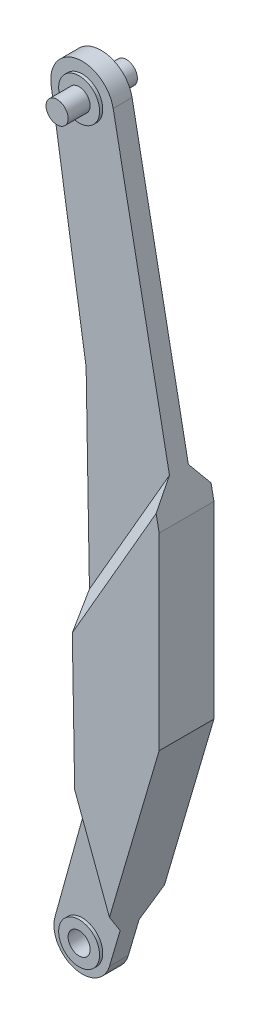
ISO-10303-21;
HEADER;
FILE_DESCRIPTION(('STEP AP214'),'2;1');
FILE_NAME('part.step','',(''),(''),'','','');
FILE_SCHEMA(('AUTOMOTIVE_DESIGN { 1 0 10303 214 1 1 1 1 }'));
ENDSEC;
DATA;
#1=APPLICATION_CONTEXT('core data for automotive mechanical design processes');
#2=APPLICATION_PROTOCOL_DEFINITION('international standard','automotive_design',2000,#1);
#3=PRODUCT_CONTEXT('',#1,'mechanical');
#4=PRODUCT('Part','Part','',(#3));
#5=PRODUCT_RELATED_PRODUCT_CATEGORY('part','',(#4));
#6=PRODUCT_DEFINITION_FORMATION('','',#4);
#7=PRODUCT_DEFINITION_CONTEXT('part definition',#1,'design');
#8=PRODUCT_DEFINITION('design','',#6,#7);
#9=PRODUCT_DEFINITION_SHAPE('','',#8);
#10=(LENGTH_UNIT() NAMED_UNIT(*) SI_UNIT(.MILLI.,.METRE.));
#11=(NAMED_UNIT(*) PLANE_ANGLE_UNIT() SI_UNIT($,.RADIAN.));
#12=(NAMED_UNIT(*) SI_UNIT($,.STERADIAN.) SOLID_ANGLE_UNIT());
#13=UNCERTAINTY_MEASURE_WITH_UNIT(LENGTH_MEASURE(1.E-05),#10,'distance_accuracy_value','');
#14=(GEOMETRIC_REPRESENTATION_CONTEXT(3) GLOBAL_UNCERTAINTY_ASSIGNED_CONTEXT((#13)) GLOBAL_UNIT_ASSIGNED_CONTEXT((#10,
#11,#12)) REPRESENTATION_CONTEXT('',''));
#15=CARTESIAN_POINT('',(0.,0.,0.));
#16=DIRECTION('',(0.,0.,1.));
#17=DIRECTION('',(1.,0.,0.));
#18=AXIS2_PLACEMENT_3D('',#15,#16,#17);
#19=CARTESIAN_POINT('',(30.4828677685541,252.56993183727,34.));
#20=DIRECTION('',(-0.994521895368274,-0.104528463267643,0.));
#21=DIRECTION('',(0.104528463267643,-0.994521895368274,0.));
#22=AXIS2_PLACEMENT_3D('',#19,#20,#21);
#23=PLANE('',#22);
#24=DIRECTION('',(-0.104528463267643,0.994521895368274,0.));
#25=VECTOR('',#24,1.);
#26=CARTESIAN_POINT('',(30.4828677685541,252.56993183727,-29.));
#27=LINE('',#26,#25);
#28=CARTESIAN_POINT('',(30.4828677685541,252.56993183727,-29.));
#29=VERTEX_POINT('',#28);
#30=CARTESIAN_POINT('',(12.5613807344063,423.081491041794,-29.));
#31=VERTEX_POINT('',#30);
#32=EDGE_CURVE('E42',#29,#31,#27,.T.);
#33=ORIENTED_EDGE('',*,*,#32,.F.);
#34=DIRECTION('',(0.,0.,-1.));
#35=VECTOR('',#34,1.);
#36=CARTESIAN_POINT('',(30.4828677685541,252.56993183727,34.));
#37=LINE('',#36,#35);
#38=CARTESIAN_POINT('',(30.4828677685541,252.56993183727,34.));
#39=VERTEX_POINT('',#38);
#40=EDGE_CURVE('E224',#39,#29,#37,.T.);
#41=ORIENTED_EDGE('',*,*,#40,.F.);
#42=DIRECTION('',(-0.104528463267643,0.994521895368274,0.));
#43=VECTOR('',#42,1.);
#44=CARTESIAN_POINT('',(30.4828677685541,252.56993183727,34.));
#45=LINE('',#44,#43);
#46=CARTESIAN_POINT('',(12.5613807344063,423.081491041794,34.));
#47=VERTEX_POINT('',#46);
#48=EDGE_CURVE('E216',#39,#47,#45,.T.);
#49=ORIENTED_EDGE('',*,*,#48,.T.);
#50=DIRECTION('',(0.,0.,-1.));
#51=VECTOR('',#50,1.);
#52=CARTESIAN_POINT('',(12.5613807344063,423.081491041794,34.));
#53=LINE('',#52,#51);
#54=EDGE_CURVE('E229',#47,#31,#53,.T.);
#55=ORIENTED_EDGE('',*,*,#54,.T.);
#56=EDGE_LOOP('',(#33,#41,#49,#55));
#57=FACE_BOUND('',#56,.T.);
#58=DIRECTION('',(0.,0.,-1.));
#59=VECTOR('',#58,1.);
#60=CARTESIAN_POINT('',(19.2983221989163,358.983774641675,28.));
#61=LINE('',#60,#59);
#62=CARTESIAN_POINT('',(19.2983221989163,358.983774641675,28.));
#63=VERTEX_POINT('',#62);
#64=CARTESIAN_POINT('',(19.2983221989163,358.983774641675,-12.));
#65=VERTEX_POINT('',#64);
#66=EDGE_CURVE('E176',#63,#65,#61,.T.);
#67=ORIENTED_EDGE('',*,*,#66,.F.);
#68=DIRECTION('',(-0.104528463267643,0.994521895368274,0.));
#69=VECTOR('',#68,1.);
#70=CARTESIAN_POINT('',(19.2983221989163,358.983774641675,28.));
#71=LINE('',#70,#69);
#72=CARTESIAN_POINT('',(29.7511685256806,259.531585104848,28.));
#73=VERTEX_POINT('',#72);
#74=EDGE_CURVE('E186',#73,#63,#71,.T.);
#75=ORIENTED_EDGE('',*,*,#74,.F.);
#76=DIRECTION('',(0.,0.,1.));
#77=VECTOR('',#76,1.);
#78=CARTESIAN_POINT('',(29.7511685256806,259.531585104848,28.));
#79=LINE('',#78,#77);
#80=CARTESIAN_POINT('',(29.7511685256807,259.531585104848,-12.));
#81=VERTEX_POINT('',#80);
#82=EDGE_CURVE('E197',#81,#73,#79,.T.);
#83=ORIENTED_EDGE('',*,*,#82,.F.);
#84=DIRECTION('',(0.104528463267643,-0.994521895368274,0.));
#85=VECTOR('',#84,1.);
#86=CARTESIAN_POINT('',(19.2983221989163,358.983774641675,-12.));
#87=LINE('',#86,#85);
#88=EDGE_CURVE('E195',#65,#81,#87,.T.);
#89=ORIENTED_EDGE('',*,*,#88,.F.);
#90=EDGE_LOOP('',(#67,#75,#83,#89));
#91=FACE_BOUND('',#90,.T.);
#92=ADVANCED_FACE('F19',(#57,#91),#23,.T.);
#93=CARTESIAN_POINT('',(6.11252669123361,792.5360917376,30.));
#94=DIRECTION('',(0.999847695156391,0.0174524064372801,0.));
#95=DIRECTION('',(-0.0174524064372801,0.999847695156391,0.));
#96=AXIS2_PLACEMENT_3D('',#93,#94,#95);
#97=PLANE('',#96);
#98=ORIENTED_EDGE('',*,*,#54,.F.);
#99=DIRECTION('',(0.01745240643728,-0.999847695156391,0.));
#100=VECTOR('',#99,1.);
#101=CARTESIAN_POINT('',(12.5613807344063,423.081491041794,34.));
#102=LINE('',#101,#100);
#103=CARTESIAN_POINT('',(15.8773973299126,233.107027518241,34.));
#104=VERTEX_POINT('',#103);
#105=EDGE_CURVE('E219',#47,#104,#102,.T.);
#106=ORIENTED_EDGE('',*,*,#105,.T.);
#107=DIRECTION('',(0.,0.,-1.));
#108=VECTOR('',#107,1.);
#109=CARTESIAN_POINT('',(15.8773973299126,233.107027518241,34.));
#110=LINE('',#109,#108);
#111=CARTESIAN_POINT('',(15.8773973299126,233.107027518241,-29.));
#112=VERTEX_POINT('',#111);
#113=EDGE_CURVE('E226',#104,#112,#110,.T.);
#114=ORIENTED_EDGE('',*,*,#113,.T.);
#115=DIRECTION('',(0.0162198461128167,-0.929234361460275,0.369134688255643));
#116=VECTOR('',#115,1.);
#117=CARTESIAN_POINT('',(18.8978234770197,60.0669294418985,39.7394970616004));
#118=LINE('',#117,#116);
#119=CARTESIAN_POINT('',(16.,226.083125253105,-26.209782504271));
#120=VERTEX_POINT('',#119);
#121=EDGE_CURVE('E282',#112,#120,#118,.T.);
#122=ORIENTED_EDGE('',*,*,#121,.T.);
#123=DIRECTION('',(0.,0.,-1.));
#124=VECTOR('',#123,1.);
#125=CARTESIAN_POINT('',(16.,226.083125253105,30.));
#126=LINE('',#125,#124);
#127=CARTESIAN_POINT('',(16.,226.083125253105,56.2097825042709));
#128=VERTEX_POINT('',#127);
#129=EDGE_CURVE('E340',#128,#120,#126,.T.);
#130=ORIENTED_EDGE('',*,*,#129,.F.);
#131=DIRECTION('',(0.0162198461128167,-0.929234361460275,-0.369134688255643));
#132=VECTOR('',#131,1.);
#133=CARTESIAN_POINT('',(10.1466043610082,561.423936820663,189.42259842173));
#134=LINE('',#133,#132);
#135=CARTESIAN_POINT('',(15.9213375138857,230.589696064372,58.));
#136=VERTEX_POINT('',#135);
#137=EDGE_CURVE('E373',#128,#136,#134,.F.);
#138=ORIENTED_EDGE('',*,*,#137,.T.);
#139=DIRECTION('',(0.0174524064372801,-0.999847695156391,0.));
#140=VECTOR('',#139,1.);
#141=CARTESIAN_POINT('',(11.3932140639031,490.005714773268,58.));
#142=LINE('',#141,#140);
#143=CARTESIAN_POINT('',(12.1893505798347,444.395084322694,58.));
#144=VERTEX_POINT('',#143);
#145=EDGE_CURVE('E242',#144,#136,#142,.T.);
#146=ORIENTED_EDGE('',*,*,#145,.F.);
#147=DIRECTION('',(0.0148740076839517,-0.852131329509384,0.523116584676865));
#148=VECTOR('',#147,1.);
#149=CARTESIAN_POINT('',(9.00423143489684,626.870437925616,-54.0201551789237));
#150=LINE('',#149,#148);
#151=CARTESIAN_POINT('',(11.3932140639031,490.005714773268,30.));
#152=VERTEX_POINT('',#151);
#153=EDGE_CURVE('E375',#144,#152,#150,.F.);
#154=ORIENTED_EDGE('',*,*,#153,.T.);
#155=DIRECTION('',(0.0174524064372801,-0.999847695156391,0.));
#156=VECTOR('',#155,1.);
#157=CARTESIAN_POINT('',(6.11252669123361,792.5360917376,30.));
#158=LINE('',#157,#156);
#159=CARTESIAN_POINT('',(6.11252669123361,792.5360917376,30.));
#160=VERTEX_POINT('',#159);
#161=EDGE_CURVE('E319',#160,#152,#158,.T.);
#162=ORIENTED_EDGE('',*,*,#161,.F.);
#163=DIRECTION('',(0.,0.,-1.));
#164=VECTOR('',#163,1.);
#165=CARTESIAN_POINT('',(6.11252669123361,792.5360917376,30.));
#166=LINE('',#165,#164);
#167=CARTESIAN_POINT('',(6.11252669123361,792.5360917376,0.));
#168=VERTEX_POINT('',#167);
#169=EDGE_CURVE('E342',#160,#168,#166,.T.);
#170=ORIENTED_EDGE('',*,*,#169,.T.);
#171=DIRECTION('',(0.0174524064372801,-0.999847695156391,0.));
#172=VECTOR('',#171,1.);
#173=CARTESIAN_POINT('',(6.11252669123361,792.5360917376,0.));
#174=LINE('',#173,#172);
#175=CARTESIAN_POINT('',(11.3932140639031,490.005714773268,0.));
#176=VERTEX_POINT('',#175);
#177=EDGE_CURVE('E302',#168,#176,#174,.T.);
#178=ORIENTED_EDGE('',*,*,#177,.T.);
#179=DIRECTION('',(0.0148740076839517,-0.852131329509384,-0.523116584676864));
#180=VECTOR('',#179,1.);
#181=CARTESIAN_POINT('',(8.63297277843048,648.139832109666,97.077265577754));
#182=LINE('',#181,#180);
#183=CARTESIAN_POINT('',(12.2177840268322,442.766133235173,-29.));
#184=VERTEX_POINT('',#183);
#185=EDGE_CURVE('E353',#176,#184,#182,.T.);
#186=ORIENTED_EDGE('',*,*,#185,.T.);
#187=DIRECTION('',(0.0174524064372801,-0.999847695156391,0.));
#188=VECTOR('',#187,1.);
#189=CARTESIAN_POINT('',(11.3932140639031,490.005714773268,-29.));
#190=LINE('',#189,#188);
#191=EDGE_CURVE('E250',#184,#31,#190,.T.);
#192=ORIENTED_EDGE('',*,*,#191,.T.);
#193=EDGE_LOOP('',(#98,#106,#114,#122,#130,#138,#146,#154,#162,#170,#178,#186,#192));
#194=FACE_BOUND('',#193,.T.);
#195=ADVANCED_FACE('F392',(#194),#97,.F.);
#196=CARTESIAN_POINT('',(138.406973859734,710.,-29.));
#197=DIRECTION('',(0.,0.,1.));
#198=DIRECTION('',(1.,0.,0.));
#199=AXIS2_PLACEMENT_3D('',#196,#197,#198);
#200=PLANE('',#199);
#201=ORIENTED_EDGE('',*,*,#32,.T.);
#202=ORIENTED_EDGE('',*,*,#191,.F.);
#203=DIRECTION('',(0.5,0.866025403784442,0.));
#204=VECTOR('',#203,1.);
#205=CARTESIAN_POINT('',(159.480740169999,697.83305534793,-29.));
#206=LINE('',#205,#204);
#207=CARTESIAN_POINT('',(145.484271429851,673.590460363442,-29.));
#208=VERTEX_POINT('',#207);
#209=EDGE_CURVE('E358',#184,#208,#206,.T.);
#210=ORIENTED_EDGE('',*,*,#209,.T.);
#211=DIRECTION('',(-0.190808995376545,0.981627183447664,0.));
#212=VECTOR('',#211,1.);
#213=CARTESIAN_POINT('',(185.,470.299660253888,-29.));
#214=LINE('',#213,#212);
#215=CARTESIAN_POINT('',(150.,650.359050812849,-29.));
#216=VERTEX_POINT('',#215);
#217=EDGE_CURVE('E248',#216,#208,#214,.T.);
#218=ORIENTED_EDGE('',*,*,#217,.F.);
#219=DIRECTION('',(0.,-1.,0.));
#220=VECTOR('',#219,1.);
#221=CARTESIAN_POINT('',(150.,1062.58723828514,-29.));
#222=LINE('',#221,#220);
#223=CARTESIAN_POINT('',(150.,351.107154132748,-29.));
#224=VERTEX_POINT('',#223);
#225=EDGE_CURVE('E231',#216,#224,#222,.T.);
#226=ORIENTED_EDGE('',*,*,#225,.T.);
#227=DIRECTION('',(0.281746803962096,0.959488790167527,0.));
#228=VECTOR('',#227,1.);
#229=CARTESIAN_POINT('',(60.1138926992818,45.,-29.));
#230=LINE('',#229,#228);
#231=CARTESIAN_POINT('',(71.5505446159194,83.9475201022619,-29.));
#232=VERTEX_POINT('',#231);
#233=EDGE_CURVE('E253',#232,#224,#230,.T.);
#234=ORIENTED_EDGE('',*,*,#233,.F.);
#235=DIRECTION('',(-0.349682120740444,0.936868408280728,0.));
#236=VECTOR('',#235,1.);
#237=CARTESIAN_POINT('',(28.7909158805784,198.509126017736,-29.));
#238=LINE('',#237,#236);
#239=EDGE_CURVE('E355',#232,#112,#238,.T.);
#240=ORIENTED_EDGE('',*,*,#239,.T.);
#241=DIRECTION('',(0.600218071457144,0.799836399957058,0.));
#242=VECTOR('',#241,1.);
#243=CARTESIAN_POINT('',(30.4828677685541,252.56993183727,-29.));
#244=LINE('',#243,#242);
#245=EDGE_CURVE('E213',#112,#29,#244,.T.);
#246=ORIENTED_EDGE('',*,*,#245,.T.);
#247=EDGE_LOOP('',(#201,#202,#210,#218,#226,#234,#240,#246));
#248=FACE_BOUND('',#247,.T.);
#249=ADVANCED_FACE('F410',(#248),#200,.F.);
#250=CARTESIAN_POINT('',(0.,1160.,30.));
#251=DIRECTION('',(0.,0.,-1.));
#252=DIRECTION('',(-1.,0.,0.));
#253=AXIS2_PLACEMENT_3D('',#250,#251,#252);
#254=PLANE('',#253);
#255=CARTESIAN_POINT('',(0.,0.,30.));
#256=DIRECTION('',(0.,0.,-1.));
#257=DIRECTION('',(-1.,0.,0.));
#258=AXIS2_PLACEMENT_3D('',#255,#256,#257);
#259=CIRCLE('',#258,32.5);
#260=CARTESIAN_POINT('',(-32.5,0.,30.));
#261=VERTEX_POINT('',#260);
#262=EDGE_CURVE('E279',#261,#261,#259,.F.);
#263=ORIENTED_EDGE('',*,*,#262,.F.);
#264=EDGE_LOOP('',(#263));
#265=FACE_BOUND('',#264,.T.);
#266=DIRECTION('',(0.281746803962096,0.959488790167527,0.));
#267=VECTOR('',#266,1.);
#268=CARTESIAN_POINT('',(185.,470.299660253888,30.));
#269=LINE('',#268,#267);
#270=CARTESIAN_POINT('',(43.1769955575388,-12.6786061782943,30.));
#271=VERTEX_POINT('',#270);
#272=CARTESIAN_POINT('',(60.1138926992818,45.,30.));
#273=VERTEX_POINT('',#272);
#274=EDGE_CURVE('E326',#271,#273,#269,.T.);
#275=ORIENTED_EDGE('',*,*,#274,.T.);
#276=DIRECTION('',(-0.349682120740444,0.936868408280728,0.));
#277=VECTOR('',#276,1.);
#278=CARTESIAN_POINT('',(-312.51752598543,1043.35417195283,30.));
#279=LINE('',#278,#277);
#280=CARTESIAN_POINT('',(5.99326374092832,190.,30.));
#281=VERTEX_POINT('',#280);
#282=EDGE_CURVE('E264',#273,#281,#279,.T.);
#283=ORIENTED_EDGE('',*,*,#282,.T.);
#284=DIRECTION('',(-0.267238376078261,-0.963630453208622,0.));
#285=VECTOR('',#284,1.);
#286=CARTESIAN_POINT('',(16.,226.083125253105,30.));
#287=LINE('',#286,#285);
#288=CARTESIAN_POINT('',(-43.363370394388,12.0257269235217,30.));
#289=VERTEX_POINT('',#288);
#290=EDGE_CURVE('E322',#281,#289,#287,.T.);
#291=ORIENTED_EDGE('',*,*,#290,.T.);
#292=CARTESIAN_POINT('',(0.,0.,30.));
#293=DIRECTION('',(0.,0.,1.));
#294=DIRECTION('',(1.,0.,0.));
#295=AXIS2_PLACEMENT_3D('',#292,#293,#294);
#296=CIRCLE('',#295,45.);
#297=EDGE_CURVE('E324',#289,#271,#296,.T.);
#298=ORIENTED_EDGE('',*,*,#297,.T.);
#299=EDGE_LOOP('',(#275,#283,#291,#298));
#300=FACE_BOUND('',#299,.T.);
#301=ADVANCED_FACE('F476',(#265,#300),#254,.F.);
#302=CARTESIAN_POINT('',(0.,1160.,0.));
#303=DIRECTION('',(0.,0.,-1.));
#304=DIRECTION('',(-1.,0.,0.));
#305=AXIS2_PLACEMENT_3D('',#302,#303,#304);
#306=PLANE('',#305);
#307=DIRECTION('',(-0.349682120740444,0.936868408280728,0.));
#308=VECTOR('',#307,1.);
#309=CARTESIAN_POINT('',(-312.51752598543,1043.35417195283,0.));
#310=LINE('',#309,#308);
#311=CARTESIAN_POINT('',(60.1138926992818,45.,0.));
#312=VERTEX_POINT('',#311);
#313=CARTESIAN_POINT('',(5.99326374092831,190.,0.));
#314=VERTEX_POINT('',#313);
#315=EDGE_CURVE('E261',#312,#314,#310,.T.);
#316=ORIENTED_EDGE('',*,*,#315,.F.);
#317=DIRECTION('',(0.281746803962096,0.959488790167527,0.));
#318=VECTOR('',#317,1.);
#319=CARTESIAN_POINT('',(185.,470.299660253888,0.));
#320=LINE('',#319,#318);
#321=CARTESIAN_POINT('',(43.1769955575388,-12.6786061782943,0.));
#322=VERTEX_POINT('',#321);
#323=EDGE_CURVE('E309',#322,#312,#320,.T.);
#324=ORIENTED_EDGE('',*,*,#323,.F.);
#325=CARTESIAN_POINT('',(0.,0.,0.));
#326=DIRECTION('',(0.,0.,1.));
#327=DIRECTION('',(1.,0.,0.));
#328=AXIS2_PLACEMENT_3D('',#325,#326,#327);
#329=CIRCLE('',#328,45.);
#330=CARTESIAN_POINT('',(-43.363370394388,12.0257269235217,0.));
#331=VERTEX_POINT('',#330);
#332=EDGE_CURVE('E307',#331,#322,#329,.T.);
#333=ORIENTED_EDGE('',*,*,#332,.F.);
#334=DIRECTION('',(-0.267238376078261,-0.963630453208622,0.));
#335=VECTOR('',#334,1.);
#336=CARTESIAN_POINT('',(16.,226.083125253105,0.));
#337=LINE('',#336,#335);
#338=EDGE_CURVE('E305',#314,#331,#337,.T.);
#339=ORIENTED_EDGE('',*,*,#338,.F.);
#340=EDGE_LOOP('',(#316,#324,#333,#339));
#341=FACE_BOUND('',#340,.T.);
#342=CARTESIAN_POINT('',(0.,0.,0.));
#343=DIRECTION('',(0.,0.,-1.));
#344=DIRECTION('',(-1.,0.,0.));
#345=AXIS2_PLACEMENT_3D('',#342,#343,#344);
#346=CIRCLE('',#345,32.5);
#347=CARTESIAN_POINT('',(-32.5,0.,0.));
#348=VERTEX_POINT('',#347);
#349=EDGE_CURVE('E278',#348,#348,#346,.F.);
#350=ORIENTED_EDGE('',*,*,#349,.T.);
#351=EDGE_LOOP('',(#350));
#352=FACE_BOUND('',#351,.T.);
#353=ADVANCED_FACE('F508',(#341,#352),#306,.T.);
#354=CARTESIAN_POINT('',(0.,1160.,30.));
#355=DIRECTION('',(0.,0.,-1.));
#356=DIRECTION('',(-1.,0.,0.));
#357=AXIS2_PLACEMENT_3D('',#354,#355,#356);
#358=CIRCLE('',#357,32.5);
#359=CARTESIAN_POINT('',(-32.5,1160.,30.));
#360=VERTEX_POINT('',#359);
#361=EDGE_CURVE('E283',#360,#360,#358,.F.);
#362=ORIENTED_EDGE('',*,*,#361,.F.);
#363=EDGE_LOOP('',(#362));
#364=FACE_BOUND('',#363,.T.);
#365=ORIENTED_EDGE('',*,*,#161,.T.);
#366=DIRECTION('',(0.5,0.866025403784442,0.));
#367=VECTOR('',#366,1.);
#368=CARTESIAN_POINT('',(298.660946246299,987.568022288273,30.));
#369=LINE('',#368,#367);
#370=CARTESIAN_POINT('',(138.406973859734,710.,30.));
#371=VERTEX_POINT('',#370);
#372=EDGE_CURVE('E259',#152,#371,#369,.T.);
#373=ORIENTED_EDGE('',*,*,#372,.T.);
#374=DIRECTION('',(-0.190808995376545,0.981627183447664,0.));
#375=VECTOR('',#374,1.);
#376=CARTESIAN_POINT('',(49.0813591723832,1169.54044976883,30.));
#377=LINE('',#376,#375);
#378=CARTESIAN_POINT('',(49.0813591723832,1169.54044976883,30.));
#379=VERTEX_POINT('',#378);
#380=EDGE_CURVE('E329',#371,#379,#377,.T.);
#381=ORIENTED_EDGE('',*,*,#380,.T.);
#382=CARTESIAN_POINT('',(0.,1160.,30.));
#383=DIRECTION('',(0.,0.,1.));
#384=DIRECTION('',(-1.,0.,0.));
#385=AXIS2_PLACEMENT_3D('',#382,#383,#384);
#386=CIRCLE('',#385,50.);
#387=CARTESIAN_POINT('',(-49.4151151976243,1152.37462197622,30.));
#388=VERTEX_POINT('',#387);
#389=EDGE_CURVE('E314',#379,#388,#386,.T.);
#390=ORIENTED_EDGE('',*,*,#389,.T.);
#391=DIRECTION('',(0.15250756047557,-0.988302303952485,0.));
#392=VECTOR('',#391,1.);
#393=CARTESIAN_POINT('',(-49.4151151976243,1152.37462197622,30.));
#394=LINE('',#393,#392);
#395=EDGE_CURVE('E317',#388,#160,#394,.T.);
#396=ORIENTED_EDGE('',*,*,#395,.T.);
#397=EDGE_LOOP('',(#365,#373,#381,#390,#396));
#398=FACE_BOUND('',#397,.T.);
#399=ADVANCED_FACE('F428',(#364,#398),#254,.F.);
#400=DIRECTION('',(0.5,0.866025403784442,0.));
#401=VECTOR('',#400,1.);
#402=CARTESIAN_POINT('',(298.660946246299,987.568022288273,0.));
#403=LINE('',#402,#401);
#404=CARTESIAN_POINT('',(138.406973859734,710.,0.));
#405=VERTEX_POINT('',#404);
#406=EDGE_CURVE('E256',#176,#405,#403,.T.);
#407=ORIENTED_EDGE('',*,*,#406,.F.);
#408=ORIENTED_EDGE('',*,*,#177,.F.);
#409=DIRECTION('',(0.15250756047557,-0.988302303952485,0.));
#410=VECTOR('',#409,1.);
#411=CARTESIAN_POINT('',(-49.4151151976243,1152.37462197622,0.));
#412=LINE('',#411,#410);
#413=CARTESIAN_POINT('',(-49.4151151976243,1152.37462197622,0.));
#414=VERTEX_POINT('',#413);
#415=EDGE_CURVE('E300',#414,#168,#412,.T.);
#416=ORIENTED_EDGE('',*,*,#415,.F.);
#417=CARTESIAN_POINT('',(0.,1160.,0.));
#418=DIRECTION('',(0.,0.,1.));
#419=DIRECTION('',(-1.,0.,0.));
#420=AXIS2_PLACEMENT_3D('',#417,#418,#419);
#421=CIRCLE('',#420,50.);
#422=CARTESIAN_POINT('',(49.0813591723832,1169.54044976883,0.));
#423=VERTEX_POINT('',#422);
#424=EDGE_CURVE('E297',#423,#414,#421,.T.);
#425=ORIENTED_EDGE('',*,*,#424,.F.);
#426=DIRECTION('',(-0.190808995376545,0.981627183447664,0.));
#427=VECTOR('',#426,1.);
#428=CARTESIAN_POINT('',(49.0813591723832,1169.54044976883,0.));
#429=LINE('',#428,#427);
#430=EDGE_CURVE('E312',#405,#423,#429,.T.);
#431=ORIENTED_EDGE('',*,*,#430,.F.);
#432=EDGE_LOOP('',(#407,#408,#416,#425,#431));
#433=FACE_BOUND('',#432,.T.);
#434=CARTESIAN_POINT('',(0.,1160.,0.));
#435=DIRECTION('',(0.,0.,-1.));
#436=DIRECTION('',(-1.,0.,0.));
#437=AXIS2_PLACEMENT_3D('',#434,#435,#436);
#438=CIRCLE('',#437,32.5);
#439=CARTESIAN_POINT('',(-32.5,1160.,0.));
#440=VERTEX_POINT('',#439);
#441=EDGE_CURVE('E293',#440,#440,#438,.F.);
#442=ORIENTED_EDGE('',*,*,#441,.T.);
#443=EDGE_LOOP('',(#442));
#444=FACE_BOUND('',#443,.T.);
#445=ADVANCED_FACE('F437',(#433,#444),#306,.T.);
#446=CARTESIAN_POINT('',(0.,1160.,30.));
#447=DIRECTION('',(0.,0.,-1.));
#448=DIRECTION('',(-1.,0.,0.));
#449=AXIS2_PLACEMENT_3D('',#446,#447,#448);
#450=CYLINDRICAL_SURFACE('',#449,50.);
#451=ORIENTED_EDGE('',*,*,#424,.T.);
#452=DIRECTION('',(0.,0.,-1.));
#453=VECTOR('',#452,1.);
#454=CARTESIAN_POINT('',(-49.4151151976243,1152.37462197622,30.));
#455=LINE('',#454,#453);
#456=EDGE_CURVE('E296',#388,#414,#455,.T.);
#457=ORIENTED_EDGE('',*,*,#456,.F.);
#458=ORIENTED_EDGE('',*,*,#389,.F.);
#459=DIRECTION('',(0.,0.,-1.));
#460=VECTOR('',#459,1.);
#461=CARTESIAN_POINT('',(49.0813591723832,1169.54044976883,30.));
#462=LINE('',#461,#460);
#463=EDGE_CURVE('E331',#379,#423,#462,.T.);
#464=ORIENTED_EDGE('',*,*,#463,.T.);
#465=EDGE_LOOP('',(#451,#457,#458,#464));
#466=FACE_BOUND('',#465,.T.);
#467=ADVANCED_FACE('F21',(#466),#450,.T.);
#468=CARTESIAN_POINT('',(-49.4151151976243,1152.37462197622,30.));
#469=DIRECTION('',(0.988302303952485,0.15250756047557,0.));
#470=DIRECTION('',(-0.15250756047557,0.988302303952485,0.));
#471=AXIS2_PLACEMENT_3D('',#468,#469,#470);
#472=PLANE('',#471);
#473=ORIENTED_EDGE('',*,*,#415,.T.);
#474=ORIENTED_EDGE('',*,*,#169,.F.);
#475=ORIENTED_EDGE('',*,*,#395,.F.);
#476=ORIENTED_EDGE('',*,*,#456,.T.);
#477=EDGE_LOOP('',(#473,#474,#475,#476));
#478=FACE_BOUND('',#477,.T.);
#479=ADVANCED_FACE('F433',(#478),#472,.F.);
#480=CARTESIAN_POINT('',(16.,226.083125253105,30.));
#481=DIRECTION('',(0.963630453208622,-0.267238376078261,0.));
#482=DIRECTION('',(0.267238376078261,0.963630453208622,0.));
#483=AXIS2_PLACEMENT_3D('',#480,#481,#482);
#484=PLANE('',#483);
#485=ORIENTED_EDGE('',*,*,#290,.F.);
#486=DIRECTION('',(-0.218934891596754,-0.789453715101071,-0.57343730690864));
#487=VECTOR('',#486,1.);
#488=CARTESIAN_POINT('',(75.9828690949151,442.374363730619,213.317745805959));
#489=LINE('',#488,#487);
#490=EDGE_CURVE('E27',#281,#128,#489,.F.);
#491=ORIENTED_EDGE('',*,*,#490,.T.);
#492=ORIENTED_EDGE('',*,*,#129,.T.);
#493=DIRECTION('',(-0.218934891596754,-0.789453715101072,0.57343730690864));
#494=VECTOR('',#493,1.);
#495=CARTESIAN_POINT('',(-16.4742496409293,108.984764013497,58.847222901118));
#496=LINE('',#495,#494);
#497=EDGE_CURVE('E365',#120,#314,#496,.T.);
#498=ORIENTED_EDGE('',*,*,#497,.T.);
#499=ORIENTED_EDGE('',*,*,#338,.T.);
#500=DIRECTION('',(0.,0.,-1.));
#501=VECTOR('',#500,1.);
#502=CARTESIAN_POINT('',(-43.363370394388,12.0257269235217,30.));
#503=LINE('',#502,#501);
#504=EDGE_CURVE('E337',#289,#331,#503,.T.);
#505=ORIENTED_EDGE('',*,*,#504,.F.);
#506=EDGE_LOOP('',(#485,#491,#492,#498,#499,#505));
#507=FACE_BOUND('',#506,.T.);
#508=ADVANCED_FACE('F385',(#507),#484,.F.);
#509=CARTESIAN_POINT('',(0.,0.,30.));
#510=DIRECTION('',(0.,0.,-1.));
#511=DIRECTION('',(-1.,0.,0.));
#512=AXIS2_PLACEMENT_3D('',#509,#510,#511);
#513=CYLINDRICAL_SURFACE('',#512,45.);
#514=ORIENTED_EDGE('',*,*,#332,.T.);
#515=DIRECTION('',(0.,0.,-1.));
#516=VECTOR('',#515,1.);
#517=CARTESIAN_POINT('',(43.1769955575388,-12.6786061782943,30.));
#518=LINE('',#517,#516);
#519=EDGE_CURVE('E334',#271,#322,#518,.T.);
#520=ORIENTED_EDGE('',*,*,#519,.F.);
#521=ORIENTED_EDGE('',*,*,#297,.F.);
#522=ORIENTED_EDGE('',*,*,#504,.T.);
#523=EDGE_LOOP('',(#514,#520,#521,#522));
#524=FACE_BOUND('',#523,.T.);
#525=ADVANCED_FACE('F516',(#524),#513,.T.);
#526=CARTESIAN_POINT('',(185.,470.299660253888,30.));
#527=DIRECTION('',(-0.959488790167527,0.281746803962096,0.));
#528=DIRECTION('',(-0.281746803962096,-0.959488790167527,0.));
#529=AXIS2_PLACEMENT_3D('',#526,#527,#528);
#530=PLANE('',#529);
#531=ORIENTED_EDGE('',*,*,#233,.T.);
#532=DIRECTION('',(0.,0.,1.));
#533=VECTOR('',#532,1.);
#534=CARTESIAN_POINT('',(150.,351.107154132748,30.));
#535=LINE('',#534,#533);
#536=CARTESIAN_POINT('',(150.,351.107154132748,58.));
#537=VERTEX_POINT('',#536);
#538=EDGE_CURVE('E237',#224,#537,#535,.T.);
#539=ORIENTED_EDGE('',*,*,#538,.T.);
#540=DIRECTION('',(0.281746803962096,0.959488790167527,0.));
#541=VECTOR('',#540,1.);
#542=CARTESIAN_POINT('',(60.1138926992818,45.,58.));
#543=LINE('',#542,#541);
#544=CARTESIAN_POINT('',(71.1561773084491,82.6045021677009,58.));
#545=VERTEX_POINT('',#544);
#546=EDGE_CURVE('E245',#545,#537,#543,.T.);
#547=ORIENTED_EDGE('',*,*,#546,.F.);
#548=DIRECTION('',(0.229251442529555,0.780715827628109,0.581314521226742));
#549=VECTOR('',#548,1.);
#550=CARTESIAN_POINT('',(155.403446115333,369.508590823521,271.626401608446));
#551=LINE('',#550,#549);
#552=EDGE_CURVE('E380',#545,#273,#551,.F.);
#553=ORIENTED_EDGE('',*,*,#552,.T.);
#554=ORIENTED_EDGE('',*,*,#274,.F.);
#555=ORIENTED_EDGE('',*,*,#519,.T.);
#556=ORIENTED_EDGE('',*,*,#323,.T.);
#557=DIRECTION('',(0.229251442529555,0.780715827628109,-0.581314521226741));
#558=VECTOR('',#557,1.);
#559=CARTESIAN_POINT('',(60.1138926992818,45.,1.31838984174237E-13));
#560=LINE('',#559,#558);
#561=EDGE_CURVE('E363',#312,#232,#560,.T.);
#562=ORIENTED_EDGE('',*,*,#561,.T.);
#563=EDGE_LOOP('',(#531,#539,#547,#553,#554,#555,#556,#562));
#564=FACE_BOUND('',#563,.T.);
#565=ADVANCED_FACE('F403',(#564),#530,.F.);
#566=CARTESIAN_POINT('',(49.0813591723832,1169.54044976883,30.));
#567=DIRECTION('',(-0.981627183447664,-0.190808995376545,0.));
#568=DIRECTION('',(0.190808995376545,-0.981627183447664,0.));
#569=AXIS2_PLACEMENT_3D('',#566,#567,#568);
#570=PLANE('',#569);
#571=DIRECTION('',(-0.190808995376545,0.981627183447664,0.));
#572=VECTOR('',#571,1.);
#573=CARTESIAN_POINT('',(185.,470.299660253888,58.));
#574=LINE('',#573,#572);
#575=CARTESIAN_POINT('',(150.,650.359050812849,58.));
#576=VERTEX_POINT('',#575);
#577=CARTESIAN_POINT('',(145.240226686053,674.84596173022,58.));
#578=VERTEX_POINT('',#577);
#579=EDGE_CURVE('E240',#576,#578,#574,.T.);
#580=ORIENTED_EDGE('',*,*,#579,.F.);
#581=DIRECTION('',(0.,0.,-1.));
#582=VECTOR('',#581,1.);
#583=CARTESIAN_POINT('',(150.,650.359050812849,30.));
#584=LINE('',#583,#582);
#585=EDGE_CURVE('E234',#576,#216,#584,.T.);
#586=ORIENTED_EDGE('',*,*,#585,.T.);
#587=ORIENTED_EDGE('',*,*,#217,.T.);
#588=DIRECTION('',(-0.150317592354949,0.773316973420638,0.61594275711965));
#589=VECTOR('',#588,1.);
#590=CARTESIAN_POINT('',(138.406973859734,710.,0.));
#591=LINE('',#590,#589);
#592=EDGE_CURVE('E361',#208,#405,#591,.T.);
#593=ORIENTED_EDGE('',*,*,#592,.T.);
#594=ORIENTED_EDGE('',*,*,#430,.T.);
#595=ORIENTED_EDGE('',*,*,#463,.F.);
#596=ORIENTED_EDGE('',*,*,#380,.F.);
#597=DIRECTION('',(-0.150317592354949,0.773316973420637,-0.615942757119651));
#598=VECTOR('',#597,1.);
#599=CARTESIAN_POINT('',(142.824714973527,687.272692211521,48.1021768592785));
#600=LINE('',#599,#598);
#601=EDGE_CURVE('E377',#371,#578,#600,.F.);
#602=ORIENTED_EDGE('',*,*,#601,.T.);
#603=EDGE_LOOP('',(#580,#586,#587,#593,#594,#595,#596,#602));
#604=FACE_BOUND('',#603,.T.);
#605=ADVANCED_FACE('F417',(#604),#570,.F.);
#606=CARTESIAN_POINT('',(0.,1160.,35.));
#607=DIRECTION('',(0.,0.,-1.));
#608=DIRECTION('',(-1.,0.,0.));
#609=AXIS2_PLACEMENT_3D('',#606,#607,#608);
#610=CYLINDRICAL_SURFACE('',#609,32.5);
#611=ORIENTED_EDGE('',*,*,#441,.F.);
#612=EDGE_LOOP('',(#611));
#613=FACE_BOUND('',#612,.T.);
#614=CARTESIAN_POINT('',(0.,1160.,-5.));
#615=DIRECTION('',(0.,0.,1.));
#616=DIRECTION('',(1.,0.,0.));
#617=AXIS2_PLACEMENT_3D('',#614,#615,#616);
#618=CIRCLE('',#617,32.5);
#619=CARTESIAN_POINT('',(32.5,1160.,-5.));
#620=VERTEX_POINT('',#619);
#621=EDGE_CURVE('E284',#620,#620,#618,.T.);
#622=ORIENTED_EDGE('',*,*,#621,.T.);
#623=EDGE_LOOP('',(#622));
#624=FACE_BOUND('',#623,.T.);
#625=ADVANCED_FACE('F495',(#613,#624),#610,.T.);
#626=CARTESIAN_POINT('',(0.,1160.,-5.));
#627=DIRECTION('',(0.,0.,1.));
#628=DIRECTION('',(1.,0.,0.));
#629=AXIS2_PLACEMENT_3D('',#626,#627,#628);
#630=PLANE('',#629);
#631=CARTESIAN_POINT('',(0.,1160.,-5.));
#632=DIRECTION('',(0.,0.,1.));
#633=DIRECTION('',(1.,0.,0.));
#634=AXIS2_PLACEMENT_3D('',#631,#632,#633);
#635=CIRCLE('',#634,17.5);
#636=CARTESIAN_POINT('',(17.5,1160.,-5.));
#637=VERTEX_POINT('',#636);
#638=EDGE_CURVE('E192',#637,#637,#635,.F.);
#639=ORIENTED_EDGE('',*,*,#638,.F.);
#640=EDGE_LOOP('',(#639));
#641=FACE_BOUND('',#640,.T.);
#642=ORIENTED_EDGE('',*,*,#621,.F.);
#643=EDGE_LOOP('',(#642));
#644=FACE_BOUND('',#643,.T.);
#645=ADVANCED_FACE('F491',(#641,#644),#630,.F.);
#646=CARTESIAN_POINT('',(0.,1160.,35.));
#647=DIRECTION('',(0.,0.,1.));
#648=DIRECTION('',(1.,0.,0.));
#649=AXIS2_PLACEMENT_3D('',#646,#647,#648);
#650=CIRCLE('',#649,32.5);
#651=CARTESIAN_POINT('',(32.5,1160.,35.));
#652=VERTEX_POINT('',#651);
#653=EDGE_CURVE('E290',#652,#652,#650,.T.);
#654=ORIENTED_EDGE('',*,*,#653,.F.);
#655=EDGE_LOOP('',(#654));
#656=FACE_BOUND('',#655,.T.);
#657=ORIENTED_EDGE('',*,*,#361,.T.);
#658=EDGE_LOOP('',(#657));
#659=FACE_BOUND('',#658,.T.);
#660=ADVANCED_FACE('F494',(#656,#659),#610,.T.);
#661=CARTESIAN_POINT('',(0.,1160.,35.));
#662=DIRECTION('',(0.,0.,1.));
#663=DIRECTION('',(1.,0.,0.));
#664=AXIS2_PLACEMENT_3D('',#661,#662,#663);
#665=PLANE('',#664);
#666=ORIENTED_EDGE('',*,*,#653,.T.);
#667=EDGE_LOOP('',(#666));
#668=FACE_BOUND('',#667,.T.);
#669=CARTESIAN_POINT('',(0.,1160.,35.));
#670=DIRECTION('',(0.,0.,1.));
#671=DIRECTION('',(1.,0.,0.));
#672=AXIS2_PLACEMENT_3D('',#669,#670,#671);
#673=CIRCLE('',#672,17.5);
#674=CARTESIAN_POINT('',(17.5,1160.,35.));
#675=VERTEX_POINT('',#674);
#676=EDGE_CURVE('E287',#675,#675,#673,.T.);
#677=ORIENTED_EDGE('',*,*,#676,.F.);
#678=EDGE_LOOP('',(#677));
#679=FACE_BOUND('',#678,.T.);
#680=ADVANCED_FACE('F489',(#668,#679),#665,.T.);
#681=CARTESIAN_POINT('',(0.,0.,35.));
#682=DIRECTION('',(0.,0.,-1.));
#683=DIRECTION('',(-1.,0.,0.));
#684=AXIS2_PLACEMENT_3D('',#681,#682,#683);
#685=CYLINDRICAL_SURFACE('',#684,32.5);
#686=ORIENTED_EDGE('',*,*,#349,.F.);
#687=EDGE_LOOP('',(#686));
#688=FACE_BOUND('',#687,.T.);
#689=CARTESIAN_POINT('',(0.,0.,-5.));
#690=DIRECTION('',(0.,0.,1.));
#691=DIRECTION('',(1.,0.,0.));
#692=AXIS2_PLACEMENT_3D('',#689,#690,#691);
#693=CIRCLE('',#692,32.5);
#694=CARTESIAN_POINT('',(32.5,0.,-5.));
#695=VERTEX_POINT('',#694);
#696=EDGE_CURVE('E269',#695,#695,#693,.T.);
#697=ORIENTED_EDGE('',*,*,#696,.T.);
#698=EDGE_LOOP('',(#697));
#699=FACE_BOUND('',#698,.T.);
#700=ADVANCED_FACE('F481',(#688,#699),#685,.T.);
#701=CARTESIAN_POINT('',(0.,0.,-5.));
#702=DIRECTION('',(0.,0.,1.));
#703=DIRECTION('',(1.,0.,0.));
#704=AXIS2_PLACEMENT_3D('',#701,#702,#703);
#705=PLANE('',#704);
#706=CARTESIAN_POINT('',(0.,0.,-5.));
#707=DIRECTION('',(0.,0.,1.));
#708=DIRECTION('',(1.,0.,0.));
#709=AXIS2_PLACEMENT_3D('',#706,#707,#708);
#710=CIRCLE('',#709,17.5);
#711=CARTESIAN_POINT('',(17.5,0.,-5.));
#712=VERTEX_POINT('',#711);
#713=EDGE_CURVE('E266',#712,#712,#710,.T.);
#714=ORIENTED_EDGE('',*,*,#713,.T.);
#715=EDGE_LOOP('',(#714));
#716=FACE_BOUND('',#715,.T.);
#717=ORIENTED_EDGE('',*,*,#696,.F.);
#718=EDGE_LOOP('',(#717));
#719=FACE_BOUND('',#718,.T.);
#720=ADVANCED_FACE('F477',(#716,#719),#705,.F.);
#721=CARTESIAN_POINT('',(0.,0.,30.));
#722=DIRECTION('',(0.,0.,-1.));
#723=DIRECTION('',(-1.,0.,0.));
#724=AXIS2_PLACEMENT_3D('',#721,#722,#723);
#725=CYLINDRICAL_SURFACE('',#724,17.5);
#726=ORIENTED_EDGE('',*,*,#713,.F.);
#727=EDGE_LOOP('',(#726));
#728=FACE_BOUND('',#727,.T.);
#729=CARTESIAN_POINT('',(0.,0.,35.));
#730=DIRECTION('',(0.,0.,1.));
#731=DIRECTION('',(1.,0.,0.));
#732=AXIS2_PLACEMENT_3D('',#729,#730,#731);
#733=CIRCLE('',#732,17.5);
#734=CARTESIAN_POINT('',(17.5,0.,35.));
#735=VERTEX_POINT('',#734);
#736=EDGE_CURVE('E272',#735,#735,#733,.T.);
#737=ORIENTED_EDGE('',*,*,#736,.T.);
#738=EDGE_LOOP('',(#737));
#739=FACE_BOUND('',#738,.T.);
#740=ADVANCED_FACE('F480',(#728,#739),#725,.F.);
#741=CARTESIAN_POINT('',(0.,0.,35.));
#742=DIRECTION('',(0.,0.,1.));
#743=DIRECTION('',(1.,0.,0.));
#744=AXIS2_PLACEMENT_3D('',#741,#742,#743);
#745=CIRCLE('',#744,32.5);
#746=CARTESIAN_POINT('',(32.5,0.,35.));
#747=VERTEX_POINT('',#746);
#748=EDGE_CURVE('E275',#747,#747,#745,.T.);
#749=ORIENTED_EDGE('',*,*,#748,.F.);
#750=EDGE_LOOP('',(#749));
#751=FACE_BOUND('',#750,.T.);
#752=ORIENTED_EDGE('',*,*,#262,.T.);
#753=EDGE_LOOP('',(#752));
#754=FACE_BOUND('',#753,.T.);
#755=ADVANCED_FACE('F485',(#751,#754),#685,.T.);
#756=CARTESIAN_POINT('',(0.,0.,35.));
#757=DIRECTION('',(0.,0.,1.));
#758=DIRECTION('',(1.,0.,0.));
#759=AXIS2_PLACEMENT_3D('',#756,#757,#758);
#760=PLANE('',#759);
#761=ORIENTED_EDGE('',*,*,#748,.T.);
#762=EDGE_LOOP('',(#761));
#763=FACE_BOUND('',#762,.T.);
#764=ORIENTED_EDGE('',*,*,#736,.F.);
#765=EDGE_LOOP('',(#764));
#766=FACE_BOUND('',#765,.T.);
#767=ADVANCED_FACE('F473',(#763,#766),#760,.T.);
#768=CARTESIAN_POINT('',(138.406973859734,710.,58.));
#769=DIRECTION('',(0.,0.,1.));
#770=DIRECTION('',(1.,0.,0.));
#771=AXIS2_PLACEMENT_3D('',#768,#769,#770);
#772=PLANE('',#771);
#773=DIRECTION('',(0.,-1.,0.));
#774=VECTOR('',#773,1.);
#775=CARTESIAN_POINT('',(150.,710.,58.));
#776=LINE('',#775,#774);
#777=EDGE_CURVE('E12',#576,#537,#776,.T.);
#778=ORIENTED_EDGE('',*,*,#777,.F.);
#779=ORIENTED_EDGE('',*,*,#579,.T.);
#780=DIRECTION('',(-0.5,-0.866025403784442,0.));
#781=VECTOR('',#780,1.);
#782=CARTESIAN_POINT('',(158.754058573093,698.252605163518,58.));
#783=LINE('',#782,#781);
#784=EDGE_CURVE('E370',#578,#144,#783,.T.);
#785=ORIENTED_EDGE('',*,*,#784,.T.);
#786=ORIENTED_EDGE('',*,*,#145,.T.);
#787=DIRECTION('',(0.349682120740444,-0.936868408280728,0.));
#788=VECTOR('',#787,1.);
#789=CARTESIAN_POINT('',(-126.159169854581,611.251820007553,58.));
#790=LINE('',#789,#788);
#791=EDGE_CURVE('E367',#136,#545,#790,.T.);
#792=ORIENTED_EDGE('',*,*,#791,.T.);
#793=ORIENTED_EDGE('',*,*,#546,.T.);
#794=EDGE_LOOP('',(#778,#779,#785,#786,#792,#793));
#795=FACE_BOUND('',#794,.T.);
#796=ADVANCED_FACE('F401',(#795),#772,.T.);
#797=CARTESIAN_POINT('',(138.406973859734,710.,0.));
#798=DIRECTION('',(-0.663413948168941,0.383022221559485,-0.642787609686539));
#799=DIRECTION('',(-0.695854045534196,0.,0.718183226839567));
#800=AXIS2_PLACEMENT_3D('',#797,#798,#799);
#801=PLANE('',#800);
#802=ORIENTED_EDGE('',*,*,#592,.F.);
#803=ORIENTED_EDGE('',*,*,#209,.F.);
#804=ORIENTED_EDGE('',*,*,#185,.F.);
#805=ORIENTED_EDGE('',*,*,#406,.T.);
#806=EDGE_LOOP('',(#802,#803,#804,#805));
#807=FACE_BOUND('',#806,.T.);
#808=ADVANCED_FACE('F441',(#807),#801,.T.);
#809=CARTESIAN_POINT('',(60.1138926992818,45.,1.31838984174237E-13));
#810=DIRECTION('',(-0.717682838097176,-0.267872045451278,-0.642787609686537));
#811=DIRECTION('',(-0.66716966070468,0.,0.744905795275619));
#812=AXIS2_PLACEMENT_3D('',#809,#810,#811);
#813=PLANE('',#812);
#814=ORIENTED_EDGE('',*,*,#121,.F.);
#815=ORIENTED_EDGE('',*,*,#239,.F.);
#816=ORIENTED_EDGE('',*,*,#561,.F.);
#817=ORIENTED_EDGE('',*,*,#315,.T.);
#818=ORIENTED_EDGE('',*,*,#497,.F.);
#819=EDGE_LOOP('',(#814,#815,#816,#817,#818));
#820=FACE_BOUND('',#819,.T.);
#821=ADVANCED_FACE('F465',(#820),#813,.T.);
#822=CARTESIAN_POINT('',(158.754058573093,698.252605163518,58.));
#823=DIRECTION('',(0.663413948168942,-0.383022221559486,-0.642787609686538));
#824=DIRECTION('',(-0.695854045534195,0.,-0.718183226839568));
#825=AXIS2_PLACEMENT_3D('',#822,#823,#824);
#826=PLANE('',#825);
#827=ORIENTED_EDGE('',*,*,#601,.F.);
#828=ORIENTED_EDGE('',*,*,#372,.F.);
#829=ORIENTED_EDGE('',*,*,#153,.F.);
#830=ORIENTED_EDGE('',*,*,#784,.F.);
#831=EDGE_LOOP('',(#827,#828,#829,#830));
#832=FACE_BOUND('',#831,.T.);
#833=ADVANCED_FACE('F425',(#832),#826,.F.);
#834=CARTESIAN_POINT('',(-126.159169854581,611.251820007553,58.));
#835=DIRECTION('',(0.717682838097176,0.267872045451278,-0.642787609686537));
#836=DIRECTION('',(-0.667169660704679,0.,-0.744905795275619));
#837=AXIS2_PLACEMENT_3D('',#834,#835,#836);
#838=PLANE('',#837);
#839=ORIENTED_EDGE('',*,*,#490,.F.);
#840=ORIENTED_EDGE('',*,*,#282,.F.);
#841=ORIENTED_EDGE('',*,*,#552,.F.);
#842=ORIENTED_EDGE('',*,*,#791,.F.);
#843=ORIENTED_EDGE('',*,*,#137,.F.);
#844=EDGE_LOOP('',(#839,#840,#841,#842,#843));
#845=FACE_BOUND('',#844,.T.);
#846=ADVANCED_FACE('F397',(#845),#838,.F.);
#847=CARTESIAN_POINT('',(150.,1062.58723828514,-29.));
#848=DIRECTION('',(-1.,0.,0.));
#849=DIRECTION('',(0.,-1.,0.));
#850=AXIS2_PLACEMENT_3D('',#847,#848,#849);
#851=PLANE('',#850);
#852=ORIENTED_EDGE('',*,*,#225,.F.);
#853=ORIENTED_EDGE('',*,*,#585,.F.);
#854=ORIENTED_EDGE('',*,*,#777,.T.);
#855=ORIENTED_EDGE('',*,*,#538,.F.);
#856=EDGE_LOOP('',(#852,#853,#854,#855));
#857=FACE_BOUND('',#856,.T.);
#858=ADVANCED_FACE('F407',(#857),#851,.F.);
#859=CARTESIAN_POINT('',(30.4828677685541,252.56993183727,34.));
#860=DIRECTION('',(-0.799836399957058,0.600218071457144,0.));
#861=DIRECTION('',(-0.600218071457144,-0.799836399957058,0.));
#862=AXIS2_PLACEMENT_3D('',#859,#860,#861);
#863=PLANE('',#862);
#864=ORIENTED_EDGE('',*,*,#245,.F.);
#865=ORIENTED_EDGE('',*,*,#113,.F.);
#866=DIRECTION('',(0.600218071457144,0.799836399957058,0.));
#867=VECTOR('',#866,1.);
#868=CARTESIAN_POINT('',(30.4828677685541,252.56993183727,34.));
#869=LINE('',#868,#867);
#870=EDGE_CURVE('E222',#104,#39,#869,.T.);
#871=ORIENTED_EDGE('',*,*,#870,.T.);
#872=ORIENTED_EDGE('',*,*,#40,.T.);
#873=EDGE_LOOP('',(#864,#865,#871,#872));
#874=FACE_BOUND('',#873,.T.);
#875=ADVANCED_FACE('F443',(#874),#863,.T.);
#876=CARTESIAN_POINT('',(30.4828677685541,252.56993183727,34.));
#877=DIRECTION('',(0.,0.,1.));
#878=DIRECTION('',(1.,0.,0.));
#879=AXIS2_PLACEMENT_3D('',#876,#877,#878);
#880=PLANE('',#879);
#881=ORIENTED_EDGE('',*,*,#48,.F.);
#882=ORIENTED_EDGE('',*,*,#870,.F.);
#883=ORIENTED_EDGE('',*,*,#105,.F.);
#884=EDGE_LOOP('',(#881,#882,#883));
#885=FACE_BOUND('',#884,.T.);
#886=ADVANCED_FACE('F447',(#885),#880,.F.);
#887=CARTESIAN_POINT('',(-10.5373346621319,355.847920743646,28.));
#888=DIRECTION('',(0.,0.,-1.));
#889=DIRECTION('',(0.,1.,0.));
#890=AXIS2_PLACEMENT_3D('',#887,#888,#889);
#891=PLANE('',#890);
#892=ORIENTED_EDGE('',*,*,#74,.T.);
#893=DIRECTION('',(0.994521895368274,0.104528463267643,0.));
#894=VECTOR('',#893,1.);
#895=CARTESIAN_POINT('',(-10.5373346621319,355.847920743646,28.));
#896=LINE('',#895,#894);
#897=CARTESIAN_POINT('',(-10.5373346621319,355.847920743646,28.));
#898=VERTEX_POINT('',#897);
#899=EDGE_CURVE('E171',#898,#63,#896,.T.);
#900=ORIENTED_EDGE('',*,*,#899,.F.);
#901=DIRECTION('',(-0.104528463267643,0.994521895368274,0.));
#902=VECTOR('',#901,1.);
#903=CARTESIAN_POINT('',(-10.5373346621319,355.847920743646,28.));
#904=LINE('',#903,#902);
#905=CARTESIAN_POINT('',(-0.0844883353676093,256.395731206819,28.));
#906=VERTEX_POINT('',#905);
#907=EDGE_CURVE('E202',#906,#898,#904,.T.);
#908=ORIENTED_EDGE('',*,*,#907,.F.);
#909=DIRECTION('',(0.994521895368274,0.104528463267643,0.));
#910=VECTOR('',#909,1.);
#911=CARTESIAN_POINT('',(-0.0844883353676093,256.395731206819,28.));
#912=LINE('',#911,#910);
#913=EDGE_CURVE('E189',#906,#73,#912,.T.);
#914=ORIENTED_EDGE('',*,*,#913,.T.);
#915=EDGE_LOOP('',(#892,#900,#908,#914));
#916=FACE_BOUND('',#915,.T.);
#917=ADVANCED_FACE('F187',(#916),#891,.F.);
#918=CARTESIAN_POINT('',(-10.5373346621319,355.847920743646,28.));
#919=DIRECTION('',(0.104528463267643,-0.994521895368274,0.));
#920=DIRECTION('',(0.994521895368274,0.104528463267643,0.));
#921=AXIS2_PLACEMENT_3D('',#918,#919,#920);
#922=PLANE('',#921);
#923=ORIENTED_EDGE('',*,*,#66,.T.);
#924=DIRECTION('',(0.994521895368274,0.104528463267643,0.));
#925=VECTOR('',#924,1.);
#926=CARTESIAN_POINT('',(-10.5373346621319,355.847920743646,-12.));
#927=LINE('',#926,#925);
#928=CARTESIAN_POINT('',(-10.5373346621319,355.847920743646,-12.));
#929=VERTEX_POINT('',#928);
#930=EDGE_CURVE('E182',#929,#65,#927,.T.);
#931=ORIENTED_EDGE('',*,*,#930,.F.);
#932=DIRECTION('',(0.,0.,-1.));
#933=VECTOR('',#932,1.);
#934=CARTESIAN_POINT('',(-10.5373346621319,355.847920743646,28.));
#935=LINE('',#934,#933);
#936=EDGE_CURVE('E178',#898,#929,#935,.T.);
#937=ORIENTED_EDGE('',*,*,#936,.F.);
#938=ORIENTED_EDGE('',*,*,#899,.T.);
#939=EDGE_LOOP('',(#923,#931,#937,#938));
#940=FACE_BOUND('',#939,.T.);
#941=ADVANCED_FACE('F173',(#940),#922,.F.);
#942=CARTESIAN_POINT('',(-10.5373346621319,355.847920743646,-12.));
#943=DIRECTION('',(0.,0.,1.));
#944=DIRECTION('',(0.,-1.,0.));
#945=AXIS2_PLACEMENT_3D('',#942,#943,#944);
#946=PLANE('',#945);
#947=ORIENTED_EDGE('',*,*,#88,.T.);
#948=DIRECTION('',(0.994521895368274,0.104528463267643,0.));
#949=VECTOR('',#948,1.);
#950=CARTESIAN_POINT('',(-0.0844883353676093,256.395731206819,-12.));
#951=LINE('',#950,#949);
#952=CARTESIAN_POINT('',(-0.0844883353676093,256.395731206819,-12.));
#953=VERTEX_POINT('',#952);
#954=EDGE_CURVE('E34',#953,#81,#951,.T.);
#955=ORIENTED_EDGE('',*,*,#954,.F.);
#956=DIRECTION('',(0.104528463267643,-0.994521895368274,0.));
#957=VECTOR('',#956,1.);
#958=CARTESIAN_POINT('',(-10.5373346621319,355.847920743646,-12.));
#959=LINE('',#958,#957);
#960=EDGE_CURVE('E205',#929,#953,#959,.T.);
#961=ORIENTED_EDGE('',*,*,#960,.F.);
#962=ORIENTED_EDGE('',*,*,#930,.T.);
#963=EDGE_LOOP('',(#947,#955,#961,#962));
#964=FACE_BOUND('',#963,.T.);
#965=ADVANCED_FACE('F693',(#964),#946,.F.);
#966=CARTESIAN_POINT('',(-0.0844883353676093,256.395731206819,28.));
#967=DIRECTION('',(-0.104528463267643,0.994521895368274,0.));
#968=DIRECTION('',(-0.994521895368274,-0.104528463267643,0.));
#969=AXIS2_PLACEMENT_3D('',#966,#967,#968);
#970=PLANE('',#969);
#971=ORIENTED_EDGE('',*,*,#82,.T.);
#972=ORIENTED_EDGE('',*,*,#913,.F.);
#973=DIRECTION('',(0.,0.,1.));
#974=VECTOR('',#973,1.);
#975=CARTESIAN_POINT('',(-0.0844883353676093,256.395731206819,28.));
#976=LINE('',#975,#974);
#977=EDGE_CURVE('E207',#953,#906,#976,.T.);
#978=ORIENTED_EDGE('',*,*,#977,.F.);
#979=ORIENTED_EDGE('',*,*,#954,.T.);
#980=EDGE_LOOP('',(#971,#972,#978,#979));
#981=FACE_BOUND('',#980,.T.);
#982=ADVANCED_FACE('F689',(#981),#970,.F.);
#983=CARTESIAN_POINT('',(-0.0844883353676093,256.395731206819,28.));
#984=DIRECTION('',(0.994521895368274,0.104528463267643,0.));
#985=DIRECTION('',(-0.104528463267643,0.994521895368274,0.));
#986=AXIS2_PLACEMENT_3D('',#983,#984,#985);
#987=PLANE('',#986);
#988=ORIENTED_EDGE('',*,*,#907,.T.);
#989=ORIENTED_EDGE('',*,*,#936,.T.);
#990=ORIENTED_EDGE('',*,*,#960,.T.);
#991=ORIENTED_EDGE('',*,*,#977,.T.);
#992=EDGE_LOOP('',(#988,#989,#990,#991));
#993=FACE_BOUND('',#992,.T.);
#994=ADVANCED_FACE('F686',(#993),#987,.F.);
#995=CARTESIAN_POINT('',(0.,1160.,70.));
#996=DIRECTION('',(0.,0.,1.));
#997=DIRECTION('',(1.,0.,0.));
#998=AXIS2_PLACEMENT_3D('',#995,#996,#997);
#999=PLANE('',#998);
#1000=CARTESIAN_POINT('',(0.,1160.,70.));
#1001=DIRECTION('',(0.,0.,1.));
#1002=DIRECTION('',(1.,0.,0.));
#1003=AXIS2_PLACEMENT_3D('',#1000,#1001,#1002);
#1004=CIRCLE('',#1003,17.5);
#1005=CARTESIAN_POINT('',(17.5,1160.,70.));
#1006=VERTEX_POINT('',#1005);
#1007=EDGE_CURVE('E662',#1006,#1006,#1004,.T.);
#1008=ORIENTED_EDGE('',*,*,#1007,.T.);
#1009=EDGE_LOOP('',(#1008));
#1010=FACE_BOUND('',#1009,.T.);
#1011=ADVANCED_FACE('F658',(#1010),#999,.T.);
#1012=CARTESIAN_POINT('',(0.,1160.,70.));
#1013=DIRECTION('',(0.,0.,-1.));
#1014=DIRECTION('',(-1.,0.,0.));
#1015=AXIS2_PLACEMENT_3D('',#1012,#1013,#1014);
#1016=CYLINDRICAL_SURFACE('',#1015,17.5);
#1017=ORIENTED_EDGE('',*,*,#676,.T.);
#1018=EDGE_LOOP('',(#1017));
#1019=FACE_BOUND('',#1018,.T.);
#1020=ORIENTED_EDGE('',*,*,#1007,.F.);
#1021=EDGE_LOOP('',(#1020));
#1022=FACE_BOUND('',#1021,.T.);
#1023=ADVANCED_FACE('F654',(#1019,#1022),#1016,.T.);
#1024=CARTESIAN_POINT('',(0.,1160.,-40.));
#1025=DIRECTION('',(0.,0.,1.));
#1026=DIRECTION('',(1.,0.,0.));
#1027=AXIS2_PLACEMENT_3D('',#1024,#1025,#1026);
#1028=CIRCLE('',#1027,17.5);
#1029=CARTESIAN_POINT('',(17.5,1160.,-40.));
#1030=VERTEX_POINT('',#1029);
#1031=EDGE_CURVE('E664',#1030,#1030,#1028,.F.);
#1032=ORIENTED_EDGE('',*,*,#1031,.F.);
#1033=EDGE_LOOP('',(#1032));
#1034=FACE_BOUND('',#1033,.T.);
#1035=ORIENTED_EDGE('',*,*,#638,.T.);
#1036=EDGE_LOOP('',(#1035));
#1037=FACE_BOUND('',#1036,.T.);
#1038=ADVANCED_FACE('F657',(#1034,#1037),#1016,.T.);
#1039=CARTESIAN_POINT('',(0.,1160.,-40.));
#1040=DIRECTION('',(0.,0.,1.));
#1041=DIRECTION('',(1.,0.,0.));
#1042=AXIS2_PLACEMENT_3D('',#1039,#1040,#1041);
#1043=PLANE('',#1042);
#1044=ORIENTED_EDGE('',*,*,#1031,.T.);
#1045=EDGE_LOOP('',(#1044));
#1046=FACE_BOUND('',#1045,.T.);
#1047=ADVANCED_FACE('F671',(#1046),#1043,.F.);
#1048=CLOSED_SHELL('',(#92,#195,#249,#301,#353,#399,#445,#467,#479,#508,#525,#565,#605,#625,
#645,#660,#680,#700,#720,#740,#755,#767,#796,#808,#821,#833,#846,#858,#875,#886,#917,#941,#965,
#982,#994,#1011,#1023,#1038,#1047));
#1049=MANIFOLD_SOLID_BREP('B1',#1048);
#1050=ADVANCED_BREP_SHAPE_REPRESENTATION('',(#18,#1049),#14);
#1051=SHAPE_DEFINITION_REPRESENTATION(#9,#1050);
ENDSEC;
END-ISO-10303-21;
